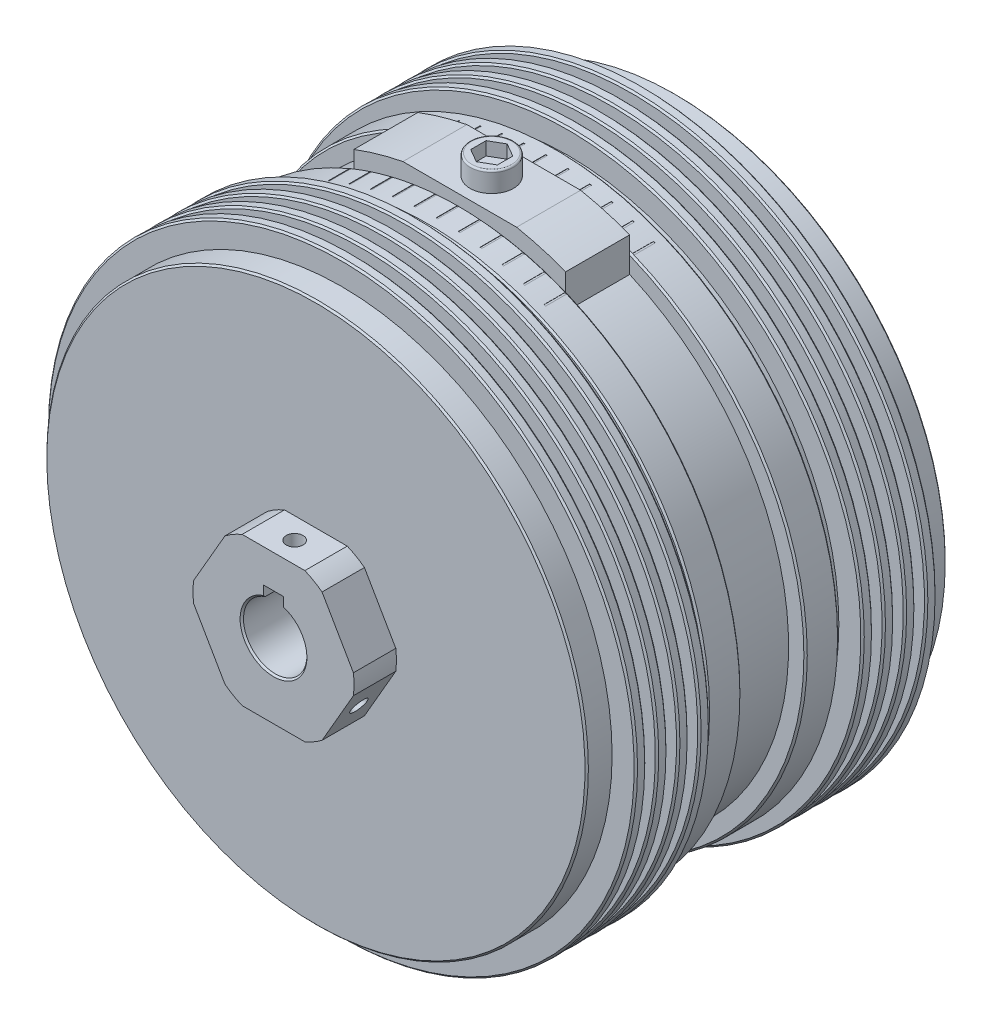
from build123d import *

# Parameters (mm, degrees)
CHAMFER1_SIZE              = 0.508
BOSS_EXTRUDE1_START        = 19.177
BOSS_EXTRUDE1_DEPTH        = 19.177
SKETCH5_R                  = 6.5024
BOSS_EXTRUDE2_DEPTH        = 5.9944
CUT_EXTRUDE3_DEPTH         = 3.9878
FILLET2_R                  = 0.508
CIRPATTERN2_COUNT          = 2
FILLET2_OF_CIRPATTERN2_R   = 0.508
CHAMFER3_SIZE              = 0.508
SKETCH19_W                 = 0.508
SKETCH19_H                 = 6.35
SKETCH19_H_2               = 6.3
CUT_EXTRUDE10_DEPTH        = 0.1016
CIRPATTERN8_COUNT          = 6
CIRPATTERN8_ANGLE          = 22.5
CIRPATTERN9_COUNT          = 6
CIRPATTERN9_ANGLE          = 22.5
CIRPATTERN10_COUNT         = 3
SKETCH22_OUTSIDE_W         = 236.47
SKETCH22_OUTSIDE_H         = 246.432
CUT_EXTRUDE11_DEPTH        = 12.7
CUT_EXTRUDE12_DEPTH        = 186.665264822
M6X1_0_TAPPED_HOLE1_REACH  = 203.086
M6X1_0_TAPPED_HOLE1_BORE_R = 2.5
CIRPATTERN11_COUNT         = 2
CIRPATTERN11_ANGLE         = 120
CUT_EXTRUDE13_DEPTH        = 10.414


with BuildPart() as part:
    # Sketch1 → Revolve1 (revolve)
    with BuildSketch(Plane(origin=(0, 0, 0), x_dir=(0, 0, -1), z_dir=(1, 0, 0)), mode=Mode.PRIVATE) as revolve1_sk:
        with BuildLine():
            Line((0, 24.13), (12.7, 24.13))
            Line((12.7, 24.13), (12.7, 81.153))
            Line((12.7, 81.153), (20.32, 81.153))
            Line((20.32, 81.153), (20.32, 88.265))
            Line((20.32, 88.265), (23.495, 88.265))
            Line((23.495, 88.265), (23.495, 81.153))
            Line((23.495, 81.153), (26.67, 81.153))
            Line((26.67, 81.153), (26.67, 88.265))
            Line((26.67, 88.265), (29.845, 88.265))
            Line((29.845, 88.265), (29.845, 81.153))
            Line((29.845, 81.153), (33.02, 81.153))
            Line((33.02, 81.153), (33.02, 88.265))
            Line((33.02, 88.265), (36.195, 88.265))
            Line((36.195, 88.265), (36.195, 81.153))
            Line((36.195, 81.153), (39.37, 81.153))
            Line((39.37, 81.153), (39.37, 88.265))
            Line((39.37, 88.265), (42.545, 88.265))
            Line((42.545, 88.265), (42.545, 81.153))
            Line((42.545, 81.153), (45.72, 81.153))
            Line((45.72, 81.153), (45.72, 84.455))
            Line((45.72, 84.455), (55.8165, 84.455))
            Line((55.8165, 84.455), (55.8165, 79.375))
            Line((55.8165, 79.375), (74.9935, 79.375))
            Line((74.9935, 79.375), (74.9935, 84.455))
            Line((74.9935, 84.455), (85.09, 84.455))
            Line((85.09, 84.455), (85.09, 81.153))
            Line((85.09, 81.153), (88.265, 81.153))
            Line((88.265, 81.153), (88.265, 88.265))
            Line((88.265, 88.265), (91.44, 88.265))
            Line((91.44, 88.265), (91.44, 81.153))
            Line((91.44, 81.153), (94.615, 81.153))
            Line((94.615, 81.153), (94.615, 88.265))
            Line((94.615, 88.265), (97.79, 88.265))
            Line((97.79, 88.265), (97.79, 81.153))
            Line((97.79, 81.153), (100.965, 81.153))
            Line((100.965, 81.153), (100.965, 88.265))
            Line((100.965, 88.265), (104.14, 88.265))
            Line((104.14, 88.265), (104.14, 81.153))
            Line((104.14, 81.153), (107.315, 81.153))
            Line((107.315, 81.153), (107.315, 88.265))
            Line((107.315, 88.265), (110.49, 88.265))
            Line((110.49, 88.265), (110.49, 81.153))
            Line((110.49, 81.153), (120.65, 81.153))
            Line((120.65, 81.153), (120.65, 41.656))
            ThreePointArc((120.65, 41.656), (120.761592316, 41.386592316), (121.031, 41.275))
            Line((121.031, 41.275), (123.698, 41.275))
            Line((123.698, 41.275), (123.698, 28.956))
            Line((123.698, 28.956), (131.2418, 28.956))
            Line((131.2418, 28.956), (131.2418, 19.812))
            Line((131.2418, 19.812), (134.112, 19.812))
            Line((134.112, 19.812), (134.112, 9.4996))
            Line((134.112, 9.4996), (0, 9.4996))
            Line((0, 9.4996), (0, 24.13))
        make_face()
    revolve(revolve1_sk.sketch.rotate(Axis((0, 0, 0), (0, 0, -1)), 90), axis=Axis((0, 0, 0), (0, 0, -1)))

    # Chamfer1
    chamfer1_edges = [part.edges().sort_by_distance(p)[0] for p in [
        (-88.265, 0, -107.315),
        (-88.265, 0, -104.14),
        (-88.265, 0, -100.965),
        (-88.265, 0, -97.79),
        (-88.265, 0, -94.615),
        (-88.265, 0, -91.44),
        (-88.265, 0, -88.265),
        (-84.455, 0, -85.09),
        (-84.455, 0, -74.9935),
        (-84.455, 0, -55.8165),
        (-84.455, 0, -45.72),
        (-88.265, 0, -42.545),
        (-88.265, 0, -39.37),
        (-88.265, 0, -36.195),
        (-88.265, 0, -33.02),
        (-88.265, 0, -29.845),
        (-88.265, 0, -26.67),
        (-88.265, 0, -23.495),
        (-88.265, 0, -20.32),
        (-9.4996, 0, 0),
        (-9.4996, 0, -134.112),
        (-41.275, 0, -123.698),
        (-88.265, 0, -110.49),
    ]]
    chamfer(chamfer1_edges, length=CHAMFER1_SIZE)

    # Sketch4 → Boss-Extrude1 (add)
    with BuildSketch(Plane(origin=(0, 0, -55.8165), x_dir=(-1, 0, 0), z_dir=(0, 0, -1)).offset(BOSS_EXTRUDE1_START)):
        with BuildLine():
            ThreePointArc((-31.75, 72.748389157), (0, 79.375), (31.75, 72.748389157))
            Line((31.75, 72.748389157), (31.75, 83.037024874))
            ThreePointArc((31.75, 83.037024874), (24.485470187, 85.461522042), (17.039227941, 87.251789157))
            Line((17.039227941, 87.251789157), (0, 87.251789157))
            Line((0, 87.251789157), (-17.039227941, 87.251789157))
            ThreePointArc((-17.039227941, 87.251789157), (-24.485470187, 85.461522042), (-31.75, 83.037024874))
            Line((-31.75, 83.037024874), (-31.75, 72.748389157))
        make_face()
    boss_extrude1 = extrude(amount=-BOSS_EXTRUDE1_DEPTH)

    # Sketch5 → Boss-Extrude2 (add)
    with BuildSketch(Plane(origin=(0, 87.251789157, 0), x_dir=(1, 0, 0), z_dir=(0, 1, 0))):
        with Locations(Location((0, 65.405, 0), (0, 0, 90))):
            Circle(SKETCH5_R)
    boss_extrude2 = extrude(amount=BOSS_EXTRUDE2_DEPTH)

    # Sketch6 → Cut-Extrude3 (cut)
    with BuildSketch(Plane(origin=(0, 93.246189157, 0), x_dir=(-1, 0, 0), z_dir=(0, 1, 0))):
        Polygon((-4.0005, -63.095310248), (-4.0005, -67.714689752), (0, -70.024379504), (4.0005, -67.714689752), (4.0005, -63.095310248), (0, -60.785620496), align=None)
    cut_extrude3 = extrude(amount=-CUT_EXTRUDE3_DEPTH, mode=Mode.SUBTRACT)

    # Fillet2
    fillet2_edges = [part.edges().sort_by_distance(p)[0] for p in [
        (0, 93.246189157, -58.9026),
    ]]
    fillet(fillet2_edges, radius=FILLET2_R)

    # CirPattern2: Boss-Extrude1, Boss-Extrude2, Cut-Extrude3 ×2 about axis
    cirpattern2_axis = Axis((0, 0, 0), (0, 0, 1))
    add([boss_extrude1.rotate(cirpattern2_axis, i * 360 / CIRPATTERN2_COUNT) for i in range(1, CIRPATTERN2_COUNT)])
    add([boss_extrude2.rotate(cirpattern2_axis, i * 360 / CIRPATTERN2_COUNT) for i in range(1, CIRPATTERN2_COUNT)])
    add([cut_extrude3.rotate(cirpattern2_axis, i * 360 / CIRPATTERN2_COUNT) for i in range(1, CIRPATTERN2_COUNT)], mode=Mode.SUBTRACT)

    # Fillet2 of CirPattern2
    fillet2_of_cirpattern2_edges = [part.edges().sort_by_distance(p)[0] for p in [
        (0, -93.246189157, -58.9026),
    ]]
    fillet(fillet2_of_cirpattern2_edges, radius=FILLET2_OF_CIRPATTERN2_R)

    # Chamfer3
    chamfer3_edges = [part.edges().sort_by_distance(p)[0] for p in [
        (-81.153, 0, -12.7),
        (-81.153, 0, -120.65),
    ]]
    chamfer(chamfer3_edges, length=CHAMFER3_SIZE)

    # Sketch19 → Cut-Extrude10 (cut)
    with BuildSketch(Plane(origin=(0, 84.455, 0), x_dir=(-1, 0, 0), z_dir=(0, 1, 0))):
        with Locations((0, -52.1335)):
            Rectangle(SKETCH19_W, SKETCH19_H)
        with Locations((0, -78.6515)):
            Rectangle(SKETCH19_W, SKETCH19_H_2)
    cut_extrude10 = extrude(amount=-CUT_EXTRUDE10_DEPTH, mode=Mode.SUBTRACT)

    # CirPattern8: Cut-Extrude10 ×6 about axis
    cirpattern8_axis = Axis((0, 0, 0), (0, 0, 1))
    for i in range(1, CIRPATTERN8_COUNT):
        add(cut_extrude10.rotate(cirpattern8_axis, i * CIRPATTERN8_ANGLE / (CIRPATTERN8_COUNT - 1)), mode=Mode.SUBTRACT)

    # CirPattern9: Cut-Extrude10 ×6 about axis
    cirpattern9_axis = Axis((0, 0, 0), (0, 0, -1))
    for i in range(1, CIRPATTERN9_COUNT):
        add(cut_extrude10.rotate(cirpattern9_axis, i * CIRPATTERN9_ANGLE / (CIRPATTERN9_COUNT - 1)), mode=Mode.SUBTRACT)

    # Sketch20 → M8x1.25 Tapped Hole1 (revolve, cut)
    with BuildSketch(Plane(origin=(0, 50.8, -120.65), x_dir=(0, 1, 0), z_dir=(1, 0, 0))):
        Polygon((0, 0), (0, 18.806926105), (3.4, 16.764), (3.4, 0), align=None)
    m8x1_25_tapped_hole1 = revolve(axis=Axis((0, 50.8, -127), (0, 0, 1)), mode=Mode.SUBTRACT)

    # CirPattern10: M8x1.25 Tapped Hole1 ×3 about axis
    cirpattern10_axis = Axis((0, 0, 0), (0, 0, 1))
    for i in range(1, CIRPATTERN10_COUNT):
        add(m8x1_25_tapped_hole1.rotate(cirpattern10_axis, i * 360 / CIRPATTERN10_COUNT), mode=Mode.SUBTRACT)

    # Sketch22 outside → Cut-Extrude11 (cut)
    with BuildSketch(Plane.XY):
        Rectangle(SKETCH22_OUTSIDE_W, SKETCH22_OUTSIDE_H)
        Polygon((-12.831609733, 22.225), (-25.663219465, 0), (-12.831609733, -22.225), (12.831609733, -22.225), (25.663219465, 0), (12.831609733, 22.225), align=None, mode=Mode.SUBTRACT)
    extrude(amount=-CUT_EXTRUDE11_DEPTH, mode=Mode.SUBTRACT)

    # Sketch23 → Cut-Extrude12 (cut, through all)
    with BuildSketch(Plane.XY):
        Polygon((0, 6.29412), (2.99974, 6.29412), (2.99974, 12.2936), (-2.99974, 12.2936), (-2.99974, 6.29412), align=None)
    extrude(amount=-CUT_EXTRUDE12_DEPTH, mode=Mode.SUBTRACT)

    # M6x1.0 Tapped Hole1 bore → M6x1.0 Tapped Hole1 (cut, up to next)
    with BuildSketch(Plane(origin=(19.247414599, -11.1125, 0), x_dir=(0, 0, -1), z_dir=(0.8660254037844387, -0.4999999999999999, 0)), mode=Mode.PRIVATE) as m6x1_0_tapped_hole1_sk1:
        with Locations((6.35, 0)):
            Circle(M6X1_0_TAPPED_HOLE1_BORE_R)
    m6x1_0_tapped_hole1_tool1 = extrude(m6x1_0_tapped_hole1_sk1.sketch, amount=-M6X1_0_TAPPED_HOLE1_REACH, mode=Mode.PRIVATE) & part.part
    m6x1_0_tapped_hole1 = m6x1_0_tapped_hole1_tool1.solids().sort_by_distance((19.247415, -11.1125, -6.35))[0]
    add(m6x1_0_tapped_hole1, mode=Mode.SUBTRACT)

    # CirPattern11: M6x1.0 Tapped Hole1 ×2 about axis
    cirpattern11_axis = Axis((0, 0, 0), (0, 0, 1))
    for i in range(1, CIRPATTERN11_COUNT):
        add(m6x1_0_tapped_hole1.rotate(cirpattern11_axis, i * CIRPATTERN11_ANGLE / (CIRPATTERN11_COUNT - 1)), mode=Mode.SUBTRACT)

    # Sketch26 → Cut-Extrude13 (cut)
    with BuildSketch(Plane(origin=(0, 0, -134.112), x_dir=(-1, 0, 0), z_dir=(0, 0, -1))):
        with BuildLine():
            Line((3.175, -28.781405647), (3.175, -26.3144))
            Line((3.175, -26.3144), (-3.175, -26.3144))
            Line((-3.175, -26.3144), (-3.175, -28.781405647))
            ThreePointArc((-3.175, -28.781405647), (0, -28.956), (3.175, -28.781405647))
        make_face()
        with BuildLine():
            Line((-28.781405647, -3.175), (-26.3144, -3.175))
            Line((-26.3144, -3.175), (-26.3144, 3.175))
            Line((-26.3144, 3.175), (-28.781405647, 3.175))
            ThreePointArc((-28.781405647, 3.175), (-28.956, 0), (-28.781405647, -3.175))
        make_face()
        with BuildLine():
            Line((-3.175, 26.3144), (3.175, 26.3144))
            Line((3.175, 26.3144), (3.175, 28.781405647))
            ThreePointArc((3.175, 28.781405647), (0, 28.956), (-3.175, 28.781405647))
            Line((-3.175, 28.781405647), (-3.175, 26.3144))
        make_face()
        with BuildLine():
            Line((26.3144, -3.175), (26.3144, 3.175))
            Line((26.3144, 3.175), (28.781405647, 3.175))
            ThreePointArc((28.781405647, 3.175), (28.956, 0), (28.781405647, -3.175))
            Line((28.781405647, -3.175), (26.3144, -3.175))
        make_face()
    extrude(amount=-CUT_EXTRUDE13_DEPTH, mode=Mode.SUBTRACT)


solid = part.part
